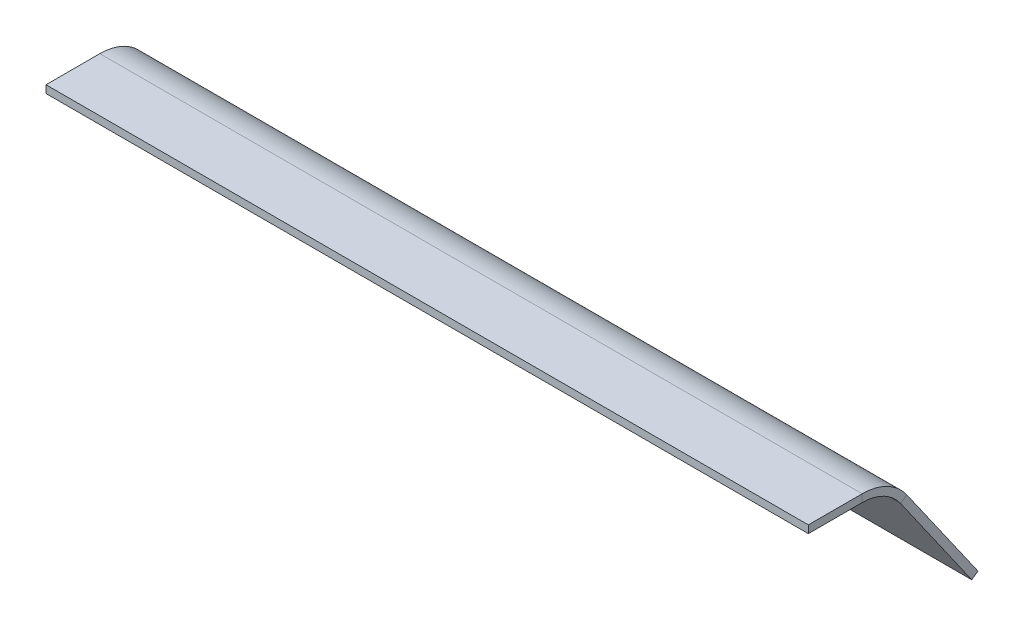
ISO-10303-21;
HEADER;
FILE_DESCRIPTION(('STEP AP214'),'2;1');
FILE_NAME('part.step','',(''),(''),'','','');
FILE_SCHEMA(('AUTOMOTIVE_DESIGN { 1 0 10303 214 1 1 1 1 }'));
ENDSEC;
DATA;
#1=APPLICATION_CONTEXT('core data for automotive mechanical design processes');
#2=APPLICATION_PROTOCOL_DEFINITION('international standard','automotive_design',2000,#1);
#3=PRODUCT_CONTEXT('',#1,'mechanical');
#4=PRODUCT('Part','Part','',(#3));
#5=PRODUCT_RELATED_PRODUCT_CATEGORY('part','',(#4));
#6=PRODUCT_DEFINITION_FORMATION('','',#4);
#7=PRODUCT_DEFINITION_CONTEXT('part definition',#1,'design');
#8=PRODUCT_DEFINITION('design','',#6,#7);
#9=PRODUCT_DEFINITION_SHAPE('','',#8);
#10=(LENGTH_UNIT() NAMED_UNIT(*) SI_UNIT(.MILLI.,.METRE.));
#11=(NAMED_UNIT(*) PLANE_ANGLE_UNIT() SI_UNIT($,.RADIAN.));
#12=(NAMED_UNIT(*) SI_UNIT($,.STERADIAN.) SOLID_ANGLE_UNIT());
#13=UNCERTAINTY_MEASURE_WITH_UNIT(LENGTH_MEASURE(1.E-05),#10,'distance_accuracy_value','');
#14=(GEOMETRIC_REPRESENTATION_CONTEXT(3) GLOBAL_UNCERTAINTY_ASSIGNED_CONTEXT((#13)) GLOBAL_UNIT_ASSIGNED_CONTEXT((#10,
#11,#12)) REPRESENTATION_CONTEXT('',''));
#15=CARTESIAN_POINT('',(0.,0.,0.));
#16=DIRECTION('',(0.,0.,1.));
#17=DIRECTION('',(1.,0.,0.));
#18=AXIS2_PLACEMENT_3D('',#15,#16,#17);
#19=CARTESIAN_POINT('',(250.,3.,25.6629257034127));
#20=DIRECTION('',(-1.,0.,0.));
#21=DIRECTION('',(0.,0.,-1.));
#22=AXIS2_PLACEMENT_3D('',#19,#20,#21);
#23=PLANE('',#22);
#24=DIRECTION('',(0.,0.,-1.));
#25=VECTOR('',#24,1.);
#26=CARTESIAN_POINT('',(250.,-2.,0.));
#27=LINE('',#26,#25);
#28=CARTESIAN_POINT('',(250.,-2.,25.6629257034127));
#29=VERTEX_POINT('',#28);
#30=CARTESIAN_POINT('',(250.,-2.,-9.66246449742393));
#31=VERTEX_POINT('',#30);
#32=EDGE_CURVE('E176',#29,#31,#27,.T.);
#33=ORIENTED_EDGE('',*,*,#32,.T.);
#34=DIRECTION('',(0.,1.,0.));
#35=VECTOR('',#34,1.);
#36=CARTESIAN_POINT('',(250.,-1.99999999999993,-9.66246449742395));
#37=LINE('',#36,#35);
#38=CARTESIAN_POINT('',(250.,3.00000000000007,-9.66246449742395));
#39=VERTEX_POINT('',#38);
#40=EDGE_CURVE('E167',#31,#39,#37,.T.);
#41=ORIENTED_EDGE('',*,*,#40,.T.);
#42=DIRECTION('',(0.,0.,-1.));
#43=VECTOR('',#42,1.);
#44=CARTESIAN_POINT('',(250.,3.,25.6629257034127));
#45=LINE('',#44,#43);
#46=CARTESIAN_POINT('',(250.,3.,25.6629257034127));
#47=VERTEX_POINT('',#46);
#48=EDGE_CURVE('E179',#47,#39,#45,.T.);
#49=ORIENTED_EDGE('',*,*,#48,.F.);
#50=DIRECTION('',(0.,1.,0.));
#51=VECTOR('',#50,1.);
#52=CARTESIAN_POINT('',(250.,3.,25.6629257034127));
#53=LINE('',#52,#51);
#54=EDGE_CURVE('E49',#29,#47,#53,.T.);
#55=ORIENTED_EDGE('',*,*,#54,.F.);
#56=EDGE_LOOP('',(#33,#41,#49,#55));
#57=FACE_BOUND('',#56,.T.);
#58=ADVANCED_FACE('F41',(#57),#23,.F.);
#59=CARTESIAN_POINT('',(0.,3.,0.));
#60=DIRECTION('',(0.,-1.,0.));
#61=DIRECTION('',(0.,0.,-1.));
#62=AXIS2_PLACEMENT_3D('',#59,#60,#61);
#63=PLANE('',#62);
#64=DIRECTION('',(1.,0.,0.));
#65=VECTOR('',#64,1.);
#66=CARTESIAN_POINT('',(250.,3.00000000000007,-9.66246449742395));
#67=LINE('',#66,#65);
#68=CARTESIAN_POINT('',(-250.,3.,-9.66246449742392));
#69=VERTEX_POINT('',#68);
#70=EDGE_CURVE('E83',#39,#69,#67,.F.);
#71=ORIENTED_EDGE('',*,*,#70,.T.);
#72=DIRECTION('',(0.,0.,1.));
#73=VECTOR('',#72,1.);
#74=CARTESIAN_POINT('',(-250.,3.,25.6629257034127));
#75=LINE('',#74,#73);
#76=CARTESIAN_POINT('',(-250.,3.,25.6629257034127));
#77=VERTEX_POINT('',#76);
#78=EDGE_CURVE('E181',#69,#77,#75,.T.);
#79=ORIENTED_EDGE('',*,*,#78,.T.);
#80=DIRECTION('',(1.,0.,0.));
#81=VECTOR('',#80,1.);
#82=CARTESIAN_POINT('',(-250.,3.,25.6629257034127));
#83=LINE('',#82,#81);
#84=EDGE_CURVE('E184',#77,#47,#83,.T.);
#85=ORIENTED_EDGE('',*,*,#84,.T.);
#86=ORIENTED_EDGE('',*,*,#48,.T.);
#87=EDGE_LOOP('',(#71,#79,#85,#86));
#88=FACE_BOUND('',#87,.T.);
#89=ADVANCED_FACE('F206',(#88),#63,.F.);
#90=CARTESIAN_POINT('',(0.,-2.,0.));
#91=DIRECTION('',(0.,-1.,0.));
#92=DIRECTION('',(0.,0.,-1.));
#93=AXIS2_PLACEMENT_3D('',#90,#91,#92);
#94=PLANE('',#93);
#95=DIRECTION('',(0.,0.,-1.));
#96=VECTOR('',#95,1.);
#97=CARTESIAN_POINT('',(-250.,-2.,0.));
#98=LINE('',#97,#96);
#99=CARTESIAN_POINT('',(-250.,-1.99999999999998,-9.66246449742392));
#100=VERTEX_POINT('',#99);
#101=CARTESIAN_POINT('',(-250.,-2.,25.6629257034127));
#102=VERTEX_POINT('',#101);
#103=EDGE_CURVE('E76',#100,#102,#98,.F.);
#104=ORIENTED_EDGE('',*,*,#103,.F.);
#105=DIRECTION('',(1.,0.,0.));
#106=VECTOR('',#105,1.);
#107=CARTESIAN_POINT('',(250.,-1.99999999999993,-9.66246449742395));
#108=LINE('',#107,#106);
#109=EDGE_CURVE('E56',#31,#100,#108,.F.);
#110=ORIENTED_EDGE('',*,*,#109,.F.);
#111=ORIENTED_EDGE('',*,*,#32,.F.);
#112=DIRECTION('',(1.,0.,0.));
#113=VECTOR('',#112,1.);
#114=CARTESIAN_POINT('',(0.,-2.,25.6629257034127));
#115=LINE('',#114,#113);
#116=EDGE_CURVE('E182',#102,#29,#115,.T.);
#117=ORIENTED_EDGE('',*,*,#116,.F.);
#118=EDGE_LOOP('',(#104,#110,#111,#117));
#119=FACE_BOUND('',#118,.T.);
#120=ADVANCED_FACE('F191',(#119),#94,.T.);
#121=CARTESIAN_POINT('',(-250.,3.,25.6629257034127));
#122=DIRECTION('',(1.,0.,0.));
#123=DIRECTION('',(0.,0.,1.));
#124=AXIS2_PLACEMENT_3D('',#121,#122,#123);
#125=PLANE('',#124);
#126=DIRECTION('',(0.,1.,0.));
#127=VECTOR('',#126,1.);
#128=CARTESIAN_POINT('',(-250.,-1.99999999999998,-9.66246449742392));
#129=LINE('',#128,#127);
#130=EDGE_CURVE('E173',#100,#69,#129,.T.);
#131=ORIENTED_EDGE('',*,*,#130,.F.);
#132=ORIENTED_EDGE('',*,*,#103,.T.);
#133=DIRECTION('',(0.,1.,0.));
#134=VECTOR('',#133,1.);
#135=CARTESIAN_POINT('',(-250.,3.,25.6629257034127));
#136=LINE('',#135,#134);
#137=EDGE_CURVE('E11',#102,#77,#136,.T.);
#138=ORIENTED_EDGE('',*,*,#137,.T.);
#139=ORIENTED_EDGE('',*,*,#78,.F.);
#140=EDGE_LOOP('',(#131,#132,#138,#139));
#141=FACE_BOUND('',#140,.T.);
#142=ADVANCED_FACE('F43',(#141),#125,.F.);
#143=CARTESIAN_POINT('',(-250.,3.,25.6629257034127));
#144=DIRECTION('',(0.,0.,-1.));
#145=DIRECTION('',(1.,0.,0.));
#146=AXIS2_PLACEMENT_3D('',#143,#144,#145);
#147=PLANE('',#146);
#148=ORIENTED_EDGE('',*,*,#137,.F.);
#149=ORIENTED_EDGE('',*,*,#116,.T.);
#150=ORIENTED_EDGE('',*,*,#54,.T.);
#151=ORIENTED_EDGE('',*,*,#84,.F.);
#152=EDGE_LOOP('',(#148,#149,#150,#151));
#153=FACE_BOUND('',#152,.T.);
#154=ADVANCED_FACE('F190',(#153),#147,.F.);
#155=CARTESIAN_POINT('',(-250.,-32.7366,-9.66246449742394));
#156=DIRECTION('',(-1.,0.,0.));
#157=DIRECTION('',(0.,-1.,0.));
#158=AXIS2_PLACEMENT_3D('',#155,#156,#157);
#159=PLANE('',#158);
#160=DIRECTION('',(0.,0.57357643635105,-0.819152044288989));
#161=VECTOR('',#160,1.);
#162=CARTESIAN_POINT('',(-250.,-15.1068105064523,-34.8404132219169));
#163=LINE('',#162,#161);
#164=CARTESIAN_POINT('',(-250.,-15.1068105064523,-34.8404132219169));
#165=VERTEX_POINT('',#164);
#166=CARTESIAN_POINT('',(-250.,-12.2389283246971,-38.9361734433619));
#167=VERTEX_POINT('',#166);
#168=EDGE_CURVE('E199',#165,#167,#163,.T.);
#169=ORIENTED_EDGE('',*,*,#168,.F.);
#170=CARTESIAN_POINT('',(-250.,-32.7366,-9.66246449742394));
#171=DIRECTION('',(1.,0.,0.));
#172=DIRECTION('',(0.,1.,0.));
#173=AXIS2_PLACEMENT_3D('',#170,#171,#172);
#174=CIRCLE('',#173,30.7366000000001);
#175=EDGE_CURVE('E123',#100,#165,#174,.F.);
#176=ORIENTED_EDGE('',*,*,#175,.F.);
#177=ORIENTED_EDGE('',*,*,#130,.T.);
#178=CARTESIAN_POINT('',(-250.,-32.7366,-9.66246449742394));
#179=DIRECTION('',(1.,0.,0.));
#180=DIRECTION('',(0.,1.,0.));
#181=AXIS2_PLACEMENT_3D('',#178,#179,#180);
#182=CIRCLE('',#181,35.7366000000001);
#183=EDGE_CURVE('E166',#69,#167,#182,.F.);
#184=ORIENTED_EDGE('',*,*,#183,.T.);
#185=EDGE_LOOP('',(#169,#176,#177,#184));
#186=FACE_BOUND('',#185,.T.);
#187=ADVANCED_FACE('F205',(#186),#159,.T.);
#188=CARTESIAN_POINT('',(250.,-32.7366,-9.66246449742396));
#189=DIRECTION('',(-1.,0.,0.));
#190=DIRECTION('',(0.,-1.,0.));
#191=AXIS2_PLACEMENT_3D('',#188,#189,#190);
#192=PLANE('',#191);
#193=CARTESIAN_POINT('',(250.,-32.7366,-9.66246449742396));
#194=DIRECTION('',(1.,0.,0.));
#195=DIRECTION('',(0.,1.,0.));
#196=AXIS2_PLACEMENT_3D('',#193,#194,#195);
#197=CIRCLE('',#196,30.7366000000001);
#198=CARTESIAN_POINT('',(250.,-15.1068105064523,-34.840413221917));
#199=VERTEX_POINT('',#198);
#200=EDGE_CURVE('E130',#199,#31,#197,.T.);
#201=ORIENTED_EDGE('',*,*,#200,.F.);
#202=DIRECTION('',(0.,0.57357643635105,-0.819152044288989));
#203=VECTOR('',#202,1.);
#204=CARTESIAN_POINT('',(250.,-15.1068105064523,-34.8404132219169));
#205=LINE('',#204,#203);
#206=CARTESIAN_POINT('',(250.,-12.2389283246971,-38.9361734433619));
#207=VERTEX_POINT('',#206);
#208=EDGE_CURVE('E127',#199,#207,#205,.T.);
#209=ORIENTED_EDGE('',*,*,#208,.T.);
#210=CARTESIAN_POINT('',(250.,-32.7366,-9.66246449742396));
#211=DIRECTION('',(1.,0.,0.));
#212=DIRECTION('',(0.,1.,0.));
#213=AXIS2_PLACEMENT_3D('',#210,#211,#212);
#214=CIRCLE('',#213,35.7366000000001);
#215=EDGE_CURVE('E114',#207,#39,#214,.T.);
#216=ORIENTED_EDGE('',*,*,#215,.T.);
#217=ORIENTED_EDGE('',*,*,#40,.F.);
#218=EDGE_LOOP('',(#201,#209,#216,#217));
#219=FACE_BOUND('',#218,.T.);
#220=ADVANCED_FACE('F128',(#219),#192,.F.);
#221=CARTESIAN_POINT('',(250.,-32.7366,-9.66246449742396));
#222=DIRECTION('',(1.,0.,0.));
#223=DIRECTION('',(0.,0.57357643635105,-0.819152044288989));
#224=AXIS2_PLACEMENT_3D('',#221,#222,#223);
#225=CYLINDRICAL_SURFACE('',#224,35.7366000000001);
#226=ORIENTED_EDGE('',*,*,#70,.F.);
#227=ORIENTED_EDGE('',*,*,#215,.F.);
#228=DIRECTION('',(-1.,0.,0.));
#229=VECTOR('',#228,1.);
#230=CARTESIAN_POINT('',(0.,-12.2389283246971,-38.9361734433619));
#231=LINE('',#230,#229);
#232=EDGE_CURVE('E119',#207,#167,#231,.T.);
#233=ORIENTED_EDGE('',*,*,#232,.T.);
#234=ORIENTED_EDGE('',*,*,#183,.F.);
#235=EDGE_LOOP('',(#226,#227,#233,#234));
#236=FACE_BOUND('',#235,.T.);
#237=ADVANCED_FACE('F116',(#236),#225,.T.);
#238=CARTESIAN_POINT('',(250.,-32.7366,-9.66246449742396));
#239=DIRECTION('',(1.,0.,0.));
#240=DIRECTION('',(0.,0.57357643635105,-0.819152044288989));
#241=AXIS2_PLACEMENT_3D('',#238,#239,#240);
#242=CYLINDRICAL_SURFACE('',#241,30.7366000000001);
#243=ORIENTED_EDGE('',*,*,#109,.T.);
#244=ORIENTED_EDGE('',*,*,#175,.T.);
#245=DIRECTION('',(1.,0.,0.));
#246=VECTOR('',#245,1.);
#247=CARTESIAN_POINT('',(-250.,-15.1068105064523,-34.8404132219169));
#248=LINE('',#247,#246);
#249=EDGE_CURVE('E134',#165,#199,#248,.T.);
#250=ORIENTED_EDGE('',*,*,#249,.T.);
#251=ORIENTED_EDGE('',*,*,#200,.T.);
#252=EDGE_LOOP('',(#243,#244,#250,#251));
#253=FACE_BOUND('',#252,.T.);
#254=ADVANCED_FACE('F194',(#253),#242,.F.);
#255=CARTESIAN_POINT('',(250.,-78.9152044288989,-85.6234045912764));
#256=DIRECTION('',(-1.,0.,0.));
#257=DIRECTION('',(0.,-1.,0.));
#258=AXIS2_PLACEMENT_3D('',#255,#256,#257);
#259=PLANE('',#258);
#260=ORIENTED_EDGE('',*,*,#208,.F.);
#261=DIRECTION('',(0.,-0.819152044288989,-0.57357643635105));
#262=VECTOR('',#261,1.);
#263=CARTESIAN_POINT('',(250.,-81.7830866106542,-81.5276443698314));
#264=LINE('',#263,#262);
#265=CARTESIAN_POINT('',(250.,-81.7830866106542,-81.5276443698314));
#266=VERTEX_POINT('',#265);
#267=EDGE_CURVE('E143',#199,#266,#264,.T.);
#268=ORIENTED_EDGE('',*,*,#267,.T.);
#269=DIRECTION('',(0.,-0.57357643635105,0.819152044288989));
#270=VECTOR('',#269,1.);
#271=CARTESIAN_POINT('',(250.,-78.9152044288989,-85.6234045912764));
#272=LINE('',#271,#270);
#273=CARTESIAN_POINT('',(250.,-78.9152044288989,-85.6234045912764));
#274=VERTEX_POINT('',#273);
#275=EDGE_CURVE('E148',#274,#266,#272,.T.);
#276=ORIENTED_EDGE('',*,*,#275,.F.);
#277=DIRECTION('',(0.,-0.819152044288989,-0.57357643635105));
#278=VECTOR('',#277,1.);
#279=CARTESIAN_POINT('',(250.,-78.9152044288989,-85.6234045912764));
#280=LINE('',#279,#278);
#281=EDGE_CURVE('E139',#207,#274,#280,.T.);
#282=ORIENTED_EDGE('',*,*,#281,.F.);
#283=EDGE_LOOP('',(#260,#268,#276,#282));
#284=FACE_BOUND('',#283,.T.);
#285=ADVANCED_FACE('F146',(#284),#259,.F.);
#286=CARTESIAN_POINT('',(-250.,0.867882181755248,-29.7586859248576));
#287=DIRECTION('',(1.,0.,0.));
#288=DIRECTION('',(0.,0.,-1.));
#289=AXIS2_PLACEMENT_3D('',#286,#287,#288);
#290=PLANE('',#289);
#291=ORIENTED_EDGE('',*,*,#168,.T.);
#292=DIRECTION('',(0.,0.819152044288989,0.57357643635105));
#293=VECTOR('',#292,1.);
#294=CARTESIAN_POINT('',(-250.,0.867882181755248,-29.7586859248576));
#295=LINE('',#294,#293);
#296=CARTESIAN_POINT('',(-250.,-78.9152044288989,-85.6234045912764));
#297=VERTEX_POINT('',#296);
#298=EDGE_CURVE('E142',#297,#167,#295,.T.);
#299=ORIENTED_EDGE('',*,*,#298,.F.);
#300=DIRECTION('',(0.,-0.57357643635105,0.819152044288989));
#301=VECTOR('',#300,1.);
#302=CARTESIAN_POINT('',(-250.,-78.9152044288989,-85.6234045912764));
#303=LINE('',#302,#301);
#304=CARTESIAN_POINT('',(-250.,-81.7830866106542,-81.5276443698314));
#305=VERTEX_POINT('',#304);
#306=EDGE_CURVE('E159',#297,#305,#303,.T.);
#307=ORIENTED_EDGE('',*,*,#306,.T.);
#308=DIRECTION('',(0.,0.819152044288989,0.57357643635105));
#309=VECTOR('',#308,1.);
#310=CARTESIAN_POINT('',(-250.,-2.,-25.6629257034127));
#311=LINE('',#310,#309);
#312=EDGE_CURVE('E150',#305,#165,#311,.T.);
#313=ORIENTED_EDGE('',*,*,#312,.T.);
#314=EDGE_LOOP('',(#291,#299,#307,#313));
#315=FACE_BOUND('',#314,.T.);
#316=ADVANCED_FACE('F203',(#315),#290,.F.);
#317=CARTESIAN_POINT('',(0.,14.2675332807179,-20.3761492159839));
#318=DIRECTION('',(0.,-0.57357643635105,0.819152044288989));
#319=DIRECTION('',(0.,-0.819152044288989,-0.57357643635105));
#320=AXIS2_PLACEMENT_3D('',#317,#318,#319);
#321=PLANE('',#320);
#322=ORIENTED_EDGE('',*,*,#232,.F.);
#323=ORIENTED_EDGE('',*,*,#281,.T.);
#324=DIRECTION('',(-1.,0.,0.));
#325=VECTOR('',#324,1.);
#326=CARTESIAN_POINT('',(-250.,-78.9152044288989,-85.6234045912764));
#327=LINE('',#326,#325);
#328=EDGE_CURVE('E149',#274,#297,#327,.T.);
#329=ORIENTED_EDGE('',*,*,#328,.T.);
#330=ORIENTED_EDGE('',*,*,#298,.T.);
#331=EDGE_LOOP('',(#322,#323,#329,#330));
#332=FACE_BOUND('',#331,.T.);
#333=ADVANCED_FACE('F138',(#332),#321,.F.);
#334=CARTESIAN_POINT('',(0.,11.3996510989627,-16.2803889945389));
#335=DIRECTION('',(0.,-0.57357643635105,0.819152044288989));
#336=DIRECTION('',(0.,-0.819152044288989,-0.57357643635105));
#337=AXIS2_PLACEMENT_3D('',#334,#335,#336);
#338=PLANE('',#337);
#339=ORIENTED_EDGE('',*,*,#267,.F.);
#340=ORIENTED_EDGE('',*,*,#249,.F.);
#341=ORIENTED_EDGE('',*,*,#312,.F.);
#342=DIRECTION('',(-1.,0.,0.));
#343=VECTOR('',#342,1.);
#344=CARTESIAN_POINT('',(-250.,-81.7830866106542,-81.5276443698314));
#345=LINE('',#344,#343);
#346=EDGE_CURVE('E154',#266,#305,#345,.T.);
#347=ORIENTED_EDGE('',*,*,#346,.F.);
#348=EDGE_LOOP('',(#339,#340,#341,#347));
#349=FACE_BOUND('',#348,.T.);
#350=ADVANCED_FACE('F334',(#349),#338,.T.);
#351=CARTESIAN_POINT('',(-250.,-78.9152044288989,-85.6234045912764));
#352=DIRECTION('',(0.,0.819152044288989,0.57357643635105));
#353=DIRECTION('',(0.,-0.57357643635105,0.819152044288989));
#354=AXIS2_PLACEMENT_3D('',#351,#352,#353);
#355=PLANE('',#354);
#356=ORIENTED_EDGE('',*,*,#346,.T.);
#357=ORIENTED_EDGE('',*,*,#306,.F.);
#358=ORIENTED_EDGE('',*,*,#328,.F.);
#359=ORIENTED_EDGE('',*,*,#275,.T.);
#360=EDGE_LOOP('',(#356,#357,#358,#359));
#361=FACE_BOUND('',#360,.T.);
#362=ADVANCED_FACE('F345',(#361),#355,.F.);
#363=CLOSED_SHELL('',(#58,#89,#120,#142,#154,#187,#220,#237,#254,#285,#316,#333,#350,#362));
#364=MANIFOLD_SOLID_BREP('B2',#363);
#365=ADVANCED_BREP_SHAPE_REPRESENTATION('',(#18,#364),#14);
#366=SHAPE_DEFINITION_REPRESENTATION(#9,#365);
ENDSEC;
END-ISO-10303-21;
